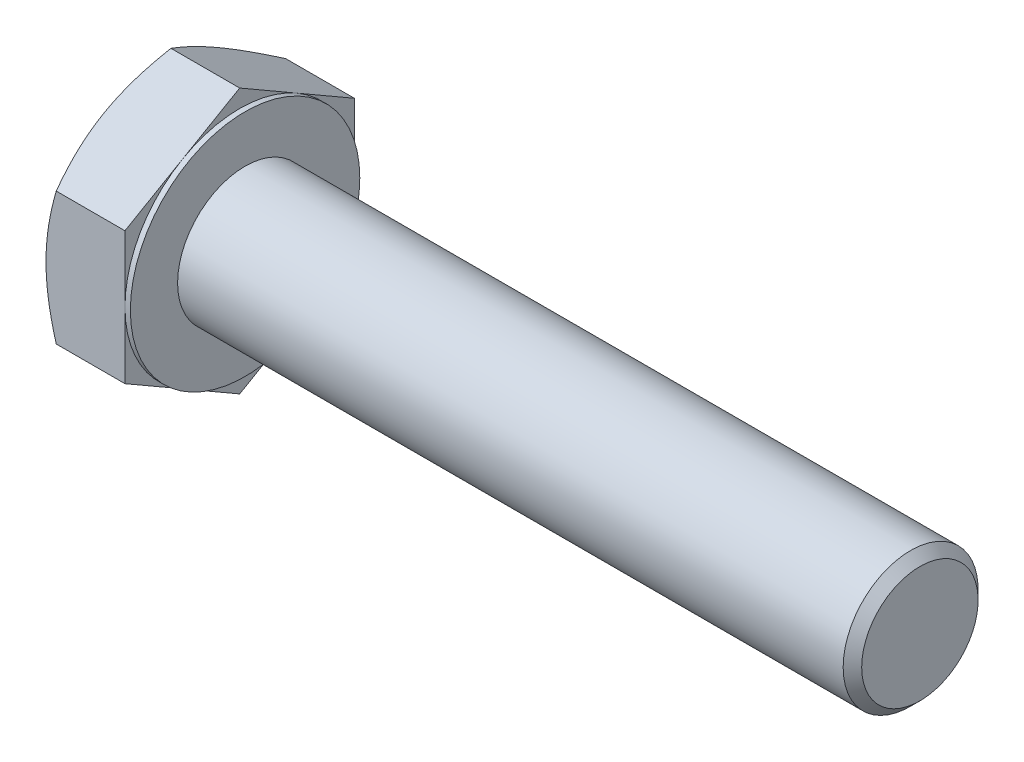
ISO-10303-21;
HEADER;
FILE_DESCRIPTION(('STEP AP214'),'2;1');
FILE_NAME('part.step','',(''),(''),'','','');
FILE_SCHEMA(('AUTOMOTIVE_DESIGN { 1 0 10303 214 1 1 1 1 }'));
ENDSEC;
DATA;
#1=APPLICATION_CONTEXT('core data for automotive mechanical design processes');
#2=APPLICATION_PROTOCOL_DEFINITION('international standard','automotive_design',2000,#1);
#3=PRODUCT_CONTEXT('',#1,'mechanical');
#4=PRODUCT('Part','Part','',(#3));
#5=PRODUCT_RELATED_PRODUCT_CATEGORY('part','',(#4));
#6=PRODUCT_DEFINITION_FORMATION('','',#4);
#7=PRODUCT_DEFINITION_CONTEXT('part definition',#1,'design');
#8=PRODUCT_DEFINITION('design','',#6,#7);
#9=PRODUCT_DEFINITION_SHAPE('','',#8);
#10=(LENGTH_UNIT() NAMED_UNIT(*) SI_UNIT(.MILLI.,.METRE.));
#11=(NAMED_UNIT(*) PLANE_ANGLE_UNIT() SI_UNIT($,.RADIAN.));
#12=(NAMED_UNIT(*) SI_UNIT($,.STERADIAN.) SOLID_ANGLE_UNIT());
#13=UNCERTAINTY_MEASURE_WITH_UNIT(LENGTH_MEASURE(1.E-05),#10,'distance_accuracy_value','');
#14=(GEOMETRIC_REPRESENTATION_CONTEXT(3) GLOBAL_UNCERTAINTY_ASSIGNED_CONTEXT((#13)) GLOBAL_UNIT_ASSIGNED_CONTEXT((#10,
#11,#12)) REPRESENTATION_CONTEXT('',''));
#15=CARTESIAN_POINT('',(0.,0.,0.));
#16=DIRECTION('',(0.,0.,1.));
#17=DIRECTION('',(1.,0.,0.));
#18=AXIS2_PLACEMENT_3D('',#15,#16,#17);
#19=CARTESIAN_POINT('',(12.5,19.6299091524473,0.));
#20=DIRECTION('',(1.,0.,0.));
#21=DIRECTION('',(0.,0.,-1.));
#22=AXIS2_PLACEMENT_3D('',#19,#20,#21);
#23=PLANE('',#22);
#24=CARTESIAN_POINT('',(12.5,0.,0.));
#25=DIRECTION('',(1.,0.,0.));
#26=DIRECTION('',(0.,0.,-1.));
#27=AXIS2_PLACEMENT_3D('',#24,#25,#26);
#28=CIRCLE('',#27,10.);
#29=CARTESIAN_POINT('',(12.5,0.,-10.));
#30=VERTEX_POINT('',#29);
#31=EDGE_CURVE('E273',#30,#30,#28,.F.);
#32=ORIENTED_EDGE('',*,*,#31,.T.);
#33=EDGE_LOOP('',(#32));
#34=FACE_BOUND('',#33,.T.);
#35=CARTESIAN_POINT('',(12.5,0.,0.));
#36=DIRECTION('',(1.,0.,0.));
#37=DIRECTION('',(0.,0.,-1.));
#38=AXIS2_PLACEMENT_3D('',#35,#36,#37);
#39=CIRCLE('',#38,17.);
#40=CARTESIAN_POINT('',(12.5,0.,-17.));
#41=VERTEX_POINT('',#40);
#42=EDGE_CURVE('E292',#41,#41,#39,.T.);
#43=ORIENTED_EDGE('',*,*,#42,.T.);
#44=EDGE_LOOP('',(#43));
#45=FACE_BOUND('',#44,.T.);
#46=ADVANCED_FACE('F35',(#34,#45),#23,.T.);
#47=CARTESIAN_POINT('',(0.,0.,0.));
#48=DIRECTION('',(-1.,0.,0.));
#49=DIRECTION('',(0.,0.,1.));
#50=AXIS2_PLACEMENT_3D('',#47,#48,#49);
#51=CYLINDRICAL_SURFACE('',#50,10.);
#52=ORIENTED_EDGE('',*,*,#31,.F.);
#53=EDGE_LOOP('',(#52));
#54=FACE_BOUND('',#53,.T.);
#55=CARTESIAN_POINT('',(111.126,0.,0.));
#56=DIRECTION('',(-1.,0.,0.));
#57=DIRECTION('',(0.,0.,1.));
#58=AXIS2_PLACEMENT_3D('',#55,#56,#57);
#59=CIRCLE('',#58,10.);
#60=CARTESIAN_POINT('',(111.126,0.,10.));
#61=VERTEX_POINT('',#60);
#62=EDGE_CURVE('E270',#61,#61,#59,.T.);
#63=ORIENTED_EDGE('',*,*,#62,.T.);
#64=EDGE_LOOP('',(#63));
#65=FACE_BOUND('',#64,.T.);
#66=ADVANCED_FACE('F244',(#54,#65),#51,.T.);
#67=CARTESIAN_POINT('',(112.5,0.,0.));
#68=DIRECTION('',(-1.,0.,0.));
#69=DIRECTION('',(0.,0.,1.));
#70=AXIS2_PLACEMENT_3D('',#67,#68,#69);
#71=CONICAL_SURFACE('',#70,8.626,0.785398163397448);
#72=ORIENTED_EDGE('',*,*,#62,.F.);
#73=EDGE_LOOP('',(#72));
#74=FACE_BOUND('',#73,.T.);
#75=CARTESIAN_POINT('',(112.5,0.,0.));
#76=DIRECTION('',(-1.,0.,0.));
#77=DIRECTION('',(0.,0.,1.));
#78=AXIS2_PLACEMENT_3D('',#75,#76,#77);
#79=CIRCLE('',#78,8.626);
#80=CARTESIAN_POINT('',(112.5,0.,8.626));
#81=VERTEX_POINT('',#80);
#82=EDGE_CURVE('E268',#81,#81,#79,.T.);
#83=ORIENTED_EDGE('',*,*,#82,.T.);
#84=EDGE_LOOP('',(#83));
#85=FACE_BOUND('',#84,.T.);
#86=ADVANCED_FACE('F249',(#74,#85),#71,.T.);
#87=CARTESIAN_POINT('',(112.5,0.,0.));
#88=DIRECTION('',(-1.,0.,0.));
#89=DIRECTION('',(0.,0.,1.));
#90=AXIS2_PLACEMENT_3D('',#87,#88,#89);
#91=PLANE('',#90);
#92=ORIENTED_EDGE('',*,*,#82,.F.);
#93=EDGE_LOOP('',(#92));
#94=FACE_BOUND('',#93,.T.);
#95=ADVANCED_FACE('F256',(#94),#91,.F.);
#96=CARTESIAN_POINT('',(11.7,17.,0.));
#97=DIRECTION('',(1.,0.,0.));
#98=DIRECTION('',(0.,0.,-1.));
#99=AXIS2_PLACEMENT_3D('',#96,#97,#98);
#100=PLANE('',#99);
#101=DIRECTION('',(0.,0.500000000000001,0.866025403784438));
#102=VECTOR('',#101,1.);
#103=CARTESIAN_POINT('',(11.7,9.81495457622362,-17.));
#104=LINE('',#103,#102);
#105=CARTESIAN_POINT('',(11.7,9.81495457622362,-17.));
#106=VERTEX_POINT('',#105);
#107=CARTESIAN_POINT('',(11.7,14.7224318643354,-8.50000000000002));
#108=VERTEX_POINT('',#107);
#109=EDGE_CURVE('E168',#106,#108,#104,.T.);
#110=ORIENTED_EDGE('',*,*,#109,.T.);
#111=CARTESIAN_POINT('',(11.7,0.,0.));
#112=DIRECTION('',(-1.,0.,0.));
#113=DIRECTION('',(0.,0.,1.));
#114=AXIS2_PLACEMENT_3D('',#111,#112,#113);
#115=CIRCLE('',#114,17.);
#116=CARTESIAN_POINT('',(11.7,0.,-17.));
#117=VERTEX_POINT('',#116);
#118=EDGE_CURVE('E51',#108,#117,#115,.T.);
#119=ORIENTED_EDGE('',*,*,#118,.T.);
#120=DIRECTION('',(0.,1.,0.));
#121=VECTOR('',#120,1.);
#122=CARTESIAN_POINT('',(11.7,9.81495457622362,-17.));
#123=LINE('',#122,#121);
#124=EDGE_CURVE('E40',#117,#106,#123,.T.);
#125=ORIENTED_EDGE('',*,*,#124,.T.);
#126=EDGE_LOOP('',(#110,#119,#125));
#127=FACE_BOUND('',#126,.T.);
#128=ADVANCED_FACE('F259',(#127),#100,.T.);
#129=CARTESIAN_POINT('',(11.7,19.6299091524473,0.));
#130=VERTEX_POINT('',#129);
#131=EDGE_CURVE('E166',#108,#130,#104,.T.);
#132=ORIENTED_EDGE('',*,*,#131,.T.);
#133=DIRECTION('',(0.,-0.500000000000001,0.866025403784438));
#134=VECTOR('',#133,1.);
#135=CARTESIAN_POINT('',(11.7,19.6299091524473,0.));
#136=LINE('',#135,#134);
#137=CARTESIAN_POINT('',(11.7,14.7224318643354,8.50000000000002));
#138=VERTEX_POINT('',#137);
#139=EDGE_CURVE('E165',#130,#138,#136,.T.);
#140=ORIENTED_EDGE('',*,*,#139,.T.);
#141=EDGE_CURVE('E154',#138,#108,#115,.T.);
#142=ORIENTED_EDGE('',*,*,#141,.T.);
#143=EDGE_LOOP('',(#132,#140,#142));
#144=FACE_BOUND('',#143,.T.);
#145=ADVANCED_FACE('F264',(#144),#100,.T.);
#146=CARTESIAN_POINT('',(11.7,9.81495457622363,17.));
#147=VERTEX_POINT('',#146);
#148=EDGE_CURVE('E133',#138,#147,#136,.T.);
#149=ORIENTED_EDGE('',*,*,#148,.T.);
#150=DIRECTION('',(0.,-1.,0.));
#151=VECTOR('',#150,1.);
#152=CARTESIAN_POINT('',(11.7,9.81495457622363,17.));
#153=LINE('',#152,#151);
#154=CARTESIAN_POINT('',(11.7,0.,17.));
#155=VERTEX_POINT('',#154);
#156=EDGE_CURVE('E127',#147,#155,#153,.T.);
#157=ORIENTED_EDGE('',*,*,#156,.T.);
#158=EDGE_CURVE('E131',#155,#138,#115,.T.);
#159=ORIENTED_EDGE('',*,*,#158,.T.);
#160=EDGE_LOOP('',(#149,#157,#159));
#161=FACE_BOUND('',#160,.T.);
#162=ADVANCED_FACE('F129',(#161),#100,.T.);
#163=CARTESIAN_POINT('',(11.7,-9.81495457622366,17.));
#164=VERTEX_POINT('',#163);
#165=EDGE_CURVE('E137',#155,#164,#153,.T.);
#166=ORIENTED_EDGE('',*,*,#165,.T.);
#167=DIRECTION('',(0.,-0.500000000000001,-0.866025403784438));
#168=VECTOR('',#167,1.);
#169=CARTESIAN_POINT('',(11.7,-19.6299091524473,0.));
#170=LINE('',#169,#168);
#171=CARTESIAN_POINT('',(11.7,-14.7224318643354,8.50000000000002));
#172=VERTEX_POINT('',#171);
#173=EDGE_CURVE('E144',#164,#172,#170,.T.);
#174=ORIENTED_EDGE('',*,*,#173,.T.);
#175=EDGE_CURVE('E141',#172,#155,#115,.T.);
#176=ORIENTED_EDGE('',*,*,#175,.T.);
#177=EDGE_LOOP('',(#166,#174,#176));
#178=FACE_BOUND('',#177,.T.);
#179=ADVANCED_FACE('F142',(#178),#100,.T.);
#180=CARTESIAN_POINT('',(11.7,-19.6299091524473,0.));
#181=VERTEX_POINT('',#180);
#182=EDGE_CURVE('E160',#172,#181,#170,.T.);
#183=ORIENTED_EDGE('',*,*,#182,.T.);
#184=DIRECTION('',(0.,0.500000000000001,-0.866025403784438));
#185=VECTOR('',#184,1.);
#186=CARTESIAN_POINT('',(11.7,-9.81495457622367,-17.));
#187=LINE('',#186,#185);
#188=CARTESIAN_POINT('',(11.7,-14.7224318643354,-8.50000000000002));
#189=VERTEX_POINT('',#188);
#190=EDGE_CURVE('E328',#181,#189,#187,.T.);
#191=ORIENTED_EDGE('',*,*,#190,.T.);
#192=EDGE_CURVE('E148',#189,#172,#115,.T.);
#193=ORIENTED_EDGE('',*,*,#192,.T.);
#194=EDGE_LOOP('',(#183,#191,#193));
#195=FACE_BOUND('',#194,.T.);
#196=ADVANCED_FACE('F333',(#195),#100,.T.);
#197=CARTESIAN_POINT('',(11.7,-9.81495457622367,-17.));
#198=VERTEX_POINT('',#197);
#199=EDGE_CURVE('E155',#189,#198,#187,.T.);
#200=ORIENTED_EDGE('',*,*,#199,.T.);
#201=EDGE_CURVE('E11',#198,#117,#123,.T.);
#202=ORIENTED_EDGE('',*,*,#201,.T.);
#203=EDGE_CURVE('E346',#117,#189,#115,.T.);
#204=ORIENTED_EDGE('',*,*,#203,.T.);
#205=EDGE_LOOP('',(#200,#202,#204));
#206=FACE_BOUND('',#205,.T.);
#207=ADVANCED_FACE('F265',(#206),#100,.T.);
#208=CARTESIAN_POINT('',(0.,0.,0.));
#209=DIRECTION('',(-1.,0.,0.));
#210=DIRECTION('',(0.,0.,1.));
#211=AXIS2_PLACEMENT_3D('',#208,#209,#210);
#212=CYLINDRICAL_SURFACE('',#211,17.);
#213=ORIENTED_EDGE('',*,*,#118,.F.);
#214=ORIENTED_EDGE('',*,*,#141,.F.);
#215=ORIENTED_EDGE('',*,*,#158,.F.);
#216=ORIENTED_EDGE('',*,*,#175,.F.);
#217=ORIENTED_EDGE('',*,*,#192,.F.);
#218=ORIENTED_EDGE('',*,*,#203,.F.);
#219=EDGE_LOOP('',(#213,#214,#215,#216,#217,#218));
#220=FACE_BOUND('',#219,.T.);
#221=ORIENTED_EDGE('',*,*,#42,.F.);
#222=EDGE_LOOP('',(#221));
#223=FACE_BOUND('',#222,.T.);
#224=ADVANCED_FACE('F151',(#220,#223),#212,.T.);
#225=CARTESIAN_POINT('',(0.,19.6299091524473,0.));
#226=DIRECTION('',(1.,0.,0.));
#227=DIRECTION('',(0.,0.,-1.));
#228=AXIS2_PLACEMENT_3D('',#225,#226,#227);
#229=PLANE('',#228);
#230=CARTESIAN_POINT('',(0.,0.,0.));
#231=DIRECTION('',(1.,0.,0.));
#232=DIRECTION('',(0.,0.,-1.));
#233=AXIS2_PLACEMENT_3D('',#230,#231,#232);
#234=CIRCLE('',#233,17.);
#235=CARTESIAN_POINT('',(0.,0.,-17.));
#236=VERTEX_POINT('',#235);
#237=CARTESIAN_POINT('',(0.,14.7224318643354,-8.50000000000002));
#238=VERTEX_POINT('',#237);
#239=EDGE_CURVE('E291',#236,#238,#234,.T.);
#240=ORIENTED_EDGE('',*,*,#239,.F.);
#241=CARTESIAN_POINT('',(0.,-14.7224318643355,-8.50000000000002));
#242=VERTEX_POINT('',#241);
#243=EDGE_CURVE('E288',#242,#236,#234,.T.);
#244=ORIENTED_EDGE('',*,*,#243,.F.);
#245=CARTESIAN_POINT('',(0.,-14.7224318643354,8.50000000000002));
#246=VERTEX_POINT('',#245);
#247=EDGE_CURVE('E290',#246,#242,#234,.T.);
#248=ORIENTED_EDGE('',*,*,#247,.F.);
#249=CARTESIAN_POINT('',(0.,0.,17.));
#250=VERTEX_POINT('',#249);
#251=EDGE_CURVE('E300',#250,#246,#234,.T.);
#252=ORIENTED_EDGE('',*,*,#251,.F.);
#253=CARTESIAN_POINT('',(0.,0.,0.));
#254=DIRECTION('',(-1.,0.,0.));
#255=DIRECTION('',(0.,0.,1.));
#256=AXIS2_PLACEMENT_3D('',#253,#254,#255);
#257=CIRCLE('',#256,17.);
#258=CARTESIAN_POINT('',(0.,14.7224318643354,8.50000000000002));
#259=VERTEX_POINT('',#258);
#260=EDGE_CURVE('E169',#250,#259,#257,.T.);
#261=ORIENTED_EDGE('',*,*,#260,.T.);
#262=EDGE_CURVE('E295',#238,#259,#234,.T.);
#263=ORIENTED_EDGE('',*,*,#262,.F.);
#264=EDGE_LOOP('',(#240,#244,#248,#252,#261,#263));
#265=FACE_BOUND('',#264,.T.);
#266=ADVANCED_FACE('F198',(#265),#229,.F.);
#267=CARTESIAN_POINT('',(0.,0.,0.));
#268=DIRECTION('',(1.,0.,0.));
#269=DIRECTION('',(0.,0.,-1.));
#270=AXIS2_PLACEMENT_3D('',#267,#268,#269);
#271=CONICAL_SURFACE('',#270,17.,1.0471975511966);
#272=CARTESIAN_POINT('',(1.51844542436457,9.81483910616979,17.0002));
#273=CARTESIAN_POINT('',(1.39390284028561,10.0305678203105,16.6265469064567));
#274=CARTESIAN_POINT('',(1.27501178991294,10.2471379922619,16.251436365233));
#275=CARTESIAN_POINT('',(1.05010368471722,10.6820149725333,15.4982073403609));
#276=CARTESIAN_POINT('',(0.944090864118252,10.9003223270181,15.1200879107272));
#277=CARTESIAN_POINT('',(0.746364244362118,11.3390955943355,14.3601103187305));
#278=CARTESIAN_POINT('',(0.654684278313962,11.5595653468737,13.9782455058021));
#279=CARTESIAN_POINT('',(0.487592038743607,12.0020367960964,13.2118624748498));
#280=CARTESIAN_POINT('',(0.412178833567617,12.2240384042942,12.8273444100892));
#281=CARTESIAN_POINT('',(0.280827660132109,12.6638851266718,12.0655075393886));
#282=CARTESIAN_POINT('',(0.224454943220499,12.8816975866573,11.6882452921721));
#283=CARTESIAN_POINT('',(0.129930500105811,13.3183205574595,10.9319921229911));
#284=CARTESIAN_POINT('',(0.0917791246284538,13.5371310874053,10.5530011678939));
#285=CARTESIAN_POINT('',(0.03466066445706,13.9751197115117,9.79438261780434));
#286=CARTESIAN_POINT('',(0.0156707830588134,14.1942970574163,9.41475631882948));
#287=CARTESIAN_POINT('',(-0.0027162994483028,14.6328540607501,8.65515330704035));
#288=CARTESIAN_POINT('',(-0.00211410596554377,14.8522337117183,8.27517660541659));
#289=CARTESIAN_POINT('',(0.0173147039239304,15.2623694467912,7.56480067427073));
#290=CARTESIAN_POINT('',(0.0337721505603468,15.4531547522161,7.23435083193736));
#291=CARTESIAN_POINT('',(0.0811925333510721,15.8342702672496,6.57423939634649));
#292=CARTESIAN_POINT('',(0.11215526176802,16.0246004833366,6.24457779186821));
#293=CARTESIAN_POINT('',(0.18804894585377,16.4047337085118,5.58616773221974));
#294=CARTESIAN_POINT('',(0.232992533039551,16.5945360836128,5.25742037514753));
#295=CARTESIAN_POINT('',(0.33605485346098,16.9732372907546,4.60149064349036));
#296=CARTESIAN_POINT('',(0.394173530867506,17.1621361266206,4.27430826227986));
#297=CARTESIAN_POINT('',(0.589770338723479,17.7355629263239,3.281103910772));
#298=CARTESIAN_POINT('',(0.746752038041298,18.1184303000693,2.61795816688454));
#299=CARTESIAN_POINT('',(1.10303610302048,18.8784560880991,1.30155488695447));
#300=CARTESIAN_POINT('',(1.30225479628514,19.2556242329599,0.648280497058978));
#301=CARTESIAN_POINT('',(1.51844542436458,19.6300246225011,-0.000199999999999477));
#302=B_SPLINE_CURVE_WITH_KNOTS('',3,(#272,#273,#274,#275,#276,#277,#278,#279,#280,#281,#282,
#283,#284,#285,#286,#287,#288,#289,#290,#291,#292,#293,#294,#295,#296,#297,#298,#299,#300,#301),
.UNSPECIFIED.,.F.,.F.,(4,2,2,2,2,2,2,2,2,2,2,2,2,2,4),(0.,1.34725361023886,2.6949489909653,
4.04577911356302,5.39653184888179,6.71394507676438,8.0313836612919,9.34725301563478,
10.6630817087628,11.808581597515,12.9540650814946,14.1005865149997,15.2471030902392,
17.590639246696,19.929575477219),.UNSPECIFIED.);
#303=CARTESIAN_POINT('',(1.51837875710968,19.6299091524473,0.));
#304=VERTEX_POINT('',#303);
#305=EDGE_CURVE('E216',#259,#304,#302,.T.);
#306=ORIENTED_EDGE('',*,*,#305,.T.);
#307=CARTESIAN_POINT('',(1.51844542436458,19.6300246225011,0.0002));
#308=CARTESIAN_POINT('',(1.39390284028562,19.4142959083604,-0.373453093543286));
#309=CARTESIAN_POINT('',(1.27501178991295,19.197725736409,-0.74856363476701));
#310=CARTESIAN_POINT('',(1.05010368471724,18.7628487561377,-1.50179265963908));
#311=CARTESIAN_POINT('',(0.944090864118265,18.5445414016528,-1.87991208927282));
#312=CARTESIAN_POINT('',(0.746364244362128,18.1057681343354,-2.6398896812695));
#313=CARTESIAN_POINT('',(0.654684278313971,17.8852983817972,-3.02175449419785));
#314=CARTESIAN_POINT('',(0.487592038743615,17.4428269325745,-3.78813752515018));
#315=CARTESIAN_POINT('',(0.412178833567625,17.2208253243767,-4.1726555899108));
#316=CARTESIAN_POINT('',(0.280827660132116,16.7809786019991,-4.93449246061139));
#317=CARTESIAN_POINT('',(0.224454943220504,16.5631661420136,-5.31175470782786));
#318=CARTESIAN_POINT('',(0.129930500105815,16.1265431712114,-6.06800787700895));
#319=CARTESIAN_POINT('',(0.0917791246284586,15.9077326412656,-6.44699883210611));
#320=CARTESIAN_POINT('',(0.0346606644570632,15.4697440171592,-7.20561738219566));
#321=CARTESIAN_POINT('',(0.0156707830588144,15.2505666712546,-7.58524368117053));
#322=CARTESIAN_POINT('',(-0.00271629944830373,14.8120096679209,-8.34484669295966));
#323=CARTESIAN_POINT('',(-0.00211410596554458,14.5926300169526,-8.72482339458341));
#324=CARTESIAN_POINT('',(0.0173147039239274,14.1824942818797,-9.43519932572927));
#325=CARTESIAN_POINT('',(0.0337721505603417,13.9917089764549,-9.76564916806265));
#326=CARTESIAN_POINT('',(0.0811925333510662,13.6105934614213,-10.4257606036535));
#327=CARTESIAN_POINT('',(0.112155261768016,13.4202632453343,-10.7554222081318));
#328=CARTESIAN_POINT('',(0.188048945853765,13.0401300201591,-11.4138322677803));
#329=CARTESIAN_POINT('',(0.232992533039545,12.8503276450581,-11.7425796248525));
#330=CARTESIAN_POINT('',(0.336054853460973,12.4716264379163,-12.3985093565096));
#331=CARTESIAN_POINT('',(0.394173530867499,12.2827276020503,-12.7256917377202));
#332=CARTESIAN_POINT('',(0.589770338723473,11.709300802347,-13.718896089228));
#333=CARTESIAN_POINT('',(0.746752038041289,11.3264334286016,-14.3820418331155));
#334=CARTESIAN_POINT('',(1.10303610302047,10.5664076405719,-15.6984451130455));
#335=CARTESIAN_POINT('',(1.30225479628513,10.189239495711,-16.351719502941));
#336=CARTESIAN_POINT('',(1.51844542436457,9.81483910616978,-17.0002));
#337=B_SPLINE_CURVE_WITH_KNOTS('',3,(#307,#308,#309,#310,#311,#312,#313,#314,#315,#316,#317,
#318,#319,#320,#321,#322,#323,#324,#325,#326,#327,#328,#329,#330,#331,#332,#333,#334,#335,#336),
.UNSPECIFIED.,.F.,.F.,(4,2,2,2,2,2,2,2,2,2,2,2,2,2,4),(0.,1.34725361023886,2.6949489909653,
4.04577911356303,5.39653184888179,6.71394507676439,8.03138366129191,9.3472530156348,
10.6630817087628,11.808581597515,12.9540650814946,14.1005865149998,15.2471030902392,
17.590639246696,19.929575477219),.UNSPECIFIED.);
#338=EDGE_CURVE('E59',#304,#238,#337,.T.);
#339=ORIENTED_EDGE('',*,*,#338,.T.);
#340=ORIENTED_EDGE('',*,*,#262,.T.);
#341=EDGE_LOOP('',(#306,#339,#340));
#342=FACE_BOUND('',#341,.T.);
#343=ADVANCED_FACE('F342',(#342),#271,.T.);
#344=CARTESIAN_POINT('',(8.32998257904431,-26.4332410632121,17.));
#345=CARTESIAN_POINT('',(8.14957795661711,-26.0617207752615,17.));
#346=CARTESIAN_POINT('',(7.97006771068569,-25.6897663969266,17.));
#347=CARTESIAN_POINT('',(7.61303838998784,-24.9448988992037,17.));
#348=CARTESIAN_POINT('',(7.43551933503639,-24.5719857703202,17.));
#349=CARTESIAN_POINT('',(6.90620624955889,-23.4515740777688,17.));
#350=CARTESIAN_POINT('',(6.55770928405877,-22.7025120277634,17.));
#351=CARTESIAN_POINT('',(5.86974011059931,-21.1953548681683,17.));
#352=CARTESIAN_POINT('',(5.5303267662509,-20.4372328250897,17.));
#353=CARTESIAN_POINT('',(4.86529195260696,-18.9149840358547,17.));
#354=CARTESIAN_POINT('',(4.53966983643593,-18.1508575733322,17.));
#355=CARTESIAN_POINT('',(3.89555967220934,-16.5904196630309,17.));
#356=CARTESIAN_POINT('',(3.57764741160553,-15.7938693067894,17.));
#357=CARTESIAN_POINT('',(2.96571562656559,-14.1914693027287,17.));
#358=CARTESIAN_POINT('',(2.67169877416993,-13.3856186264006,17.));
#359=CARTESIAN_POINT('',(2.11523043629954,-11.7648483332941,17.));
#360=CARTESIAN_POINT('',(1.85271563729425,-10.9499506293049,17.));
#361=CARTESIAN_POINT('',(1.36761452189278,-9.30838864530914,17.));
#362=CARTESIAN_POINT('',(1.14501570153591,-8.4817281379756,17.));
#363=CARTESIAN_POINT('',(0.84968713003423,-7.23506436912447,17.));
#364=CARTESIAN_POINT('',(0.757873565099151,-6.81955500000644,17.));
#365=CARTESIAN_POINT('',(0.588188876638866,-5.98568427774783,17.));
#366=CARTESIAN_POINT('',(0.51031746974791,-5.56732298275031,17.));
#367=CARTESIAN_POINT('',(0.369887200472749,-4.72803069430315,17.));
#368=CARTESIAN_POINT('',(0.307328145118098,-4.30709973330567,17.));
#369=CARTESIAN_POINT('',(0.198768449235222,-3.46311148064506,17.));
#370=CARTESIAN_POINT('',(0.152767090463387,-3.04005428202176,17.));
#371=CARTESIAN_POINT('',(0.0788167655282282,-2.19795531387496,17.));
#372=CARTESIAN_POINT('',(0.0506386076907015,-1.77893379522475,17.));
#373=CARTESIAN_POINT('',(0.0120312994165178,-0.940075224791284,17.));
#374=CARTESIAN_POINT('',(0.00160185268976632,-0.520238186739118,17.));
#375=CARTESIAN_POINT('',(-0.0012597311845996,0.319501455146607,17.));
#376=CARTESIAN_POINT('',(0.00630819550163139,0.739404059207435,17.));
#377=CARTESIAN_POINT('',(0.039255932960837,1.57851450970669,17.));
#378=CARTESIAN_POINT('',(0.0646365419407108,1.99772232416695,17.));
#379=CARTESIAN_POINT('',(0.146329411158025,3.00313432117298,17.));
#380=CARTESIAN_POINT('',(0.210977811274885,3.58867322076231,17.));
#381=CARTESIAN_POINT('',(0.371522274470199,4.75545415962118,17.));
#382=CARTESIAN_POINT('',(0.467422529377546,5.33669561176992,17.));
#383=CARTESIAN_POINT('',(0.687059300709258,6.49431136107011,17.));
#384=CARTESIAN_POINT('',(0.810817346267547,7.07068153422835,17.));
#385=CARTESIAN_POINT('',(1.08238903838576,8.21766393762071,17.));
#386=CARTESIAN_POINT('',(1.23020233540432,8.78827625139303,17.));
#387=CARTESIAN_POINT('',(1.54978178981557,9.9363085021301,17.));
#388=CARTESIAN_POINT('',(1.72200498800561,10.5136003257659,17.));
#389=CARTESIAN_POINT('',(2.0843777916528,11.6624980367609,17.));
#390=CARTESIAN_POINT('',(2.27452751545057,12.234103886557,17.));
#391=CARTESIAN_POINT('',(2.66972269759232,13.3719095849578,17.));
#392=CARTESIAN_POINT('',(2.87476328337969,13.9381111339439,17.));
#393=CARTESIAN_POINT('',(3.29731504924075,15.0658140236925,17.));
#394=CARTESIAN_POINT('',(3.5148260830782,15.6273154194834,17.));
#395=CARTESIAN_POINT('',(4.04214849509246,16.9518553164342,17.));
#396=CARTESIAN_POINT('',(4.35649197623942,17.713086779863,17.));
#397=CARTESIAN_POINT('',(5.00050456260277,19.2290585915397,17.));
#398=CARTESIAN_POINT('',(5.330174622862,19.9837985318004,17.));
#399=CARTESIAN_POINT('',(6.0017726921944,21.487995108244,17.));
#400=CARTESIAN_POINT('',(6.34370345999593,22.237450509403,17.));
#401=CARTESIAN_POINT('',(7.03734981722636,23.7317883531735,17.));
#402=CARTESIAN_POINT('',(7.38906519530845,24.4766708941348,17.));
#403=CARTESIAN_POINT('',(8.10084426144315,25.9634418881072,17.));
#404=CARTESIAN_POINT('',(8.46091674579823,26.7053261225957,17.));
#405=CARTESIAN_POINT('',(9.18760696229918,28.1858814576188,17.));
#406=CARTESIAN_POINT('',(9.55422472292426,28.9245525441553,17.));
#407=CARTESIAN_POINT('',(10.292836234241,30.3990810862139,17.));
#408=CARTESIAN_POINT('',(10.664829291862,31.1349388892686,17.));
#409=CARTESIAN_POINT('',(11.4133557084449,32.6043374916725,17.));
#410=CARTESIAN_POINT('',(11.7898890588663,33.3378782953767,17.));
#411=CARTESIAN_POINT('',(12.8616246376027,35.4124553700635,17.));
#412=CARTESIAN_POINT('',(13.5613220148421,36.7511693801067,17.));
#413=CARTESIAN_POINT('',(14.9702873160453,39.4236006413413,17.));
#414=CARTESIAN_POINT('',(15.6795555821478,40.7573177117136,17.));
#415=CARTESIAN_POINT('',(17.1036264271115,43.4174788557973,17.));
#416=CARTESIAN_POINT('',(17.8184106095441,44.7439327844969,17.));
#417=CARTESIAN_POINT('',(18.8948462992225,46.7312563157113,17.));
#418=CARTESIAN_POINT('',(19.2543582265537,47.393286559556,17.));
#419=CARTESIAN_POINT('',(19.9746598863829,48.7166502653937,17.));
#420=CARTESIAN_POINT('',(20.3354496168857,49.3779837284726,17.));
#421=CARTESIAN_POINT('',(20.696804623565,50.0390082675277,17.));
#422=B_SPLINE_CURVE_WITH_KNOTS('',3,(#344,#345,#346,#347,#348,#349,#350,#351,#352,#353,#354,
#355,#356,#357,#358,#359,#360,#361,#362,#363,#364,#365,#366,#367,#368,#369,#370,#371,#372,#373,
#374,#375,#376,#377,#378,#379,#380,#381,#382,#383,#384,#385,#386,#387,#388,#389,#390,#391,#392,
#393,#394,#395,#396,#397,#398,#399,#400,#401,#402,#403,#404,#405,#406,#407,#408,#409,#410,#411,
#412,#413,#414,#415,#416,#417,#418,#419,#420,#421),.UNSPECIFIED.,.F.,.F.,(4,2,2,2,2,2,2,2,2,2,2,
2,2,2,2,2,2,2,2,2,2,2,2,2,2,2,2,2,2,2,2,2,2,2,2,2,2,2,4),(0.,1.23901285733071,2.47803803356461,
4.95645146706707,7.44824208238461,9.93991569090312,12.5125679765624,15.0855075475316,
17.6531861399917,20.2200589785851,21.4964599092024,22.7728348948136,24.0491937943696,
25.3254973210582,26.5850358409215,27.8445533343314,29.1040752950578,30.3636537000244,
32.1299687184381,33.8965207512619,35.6644427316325,37.4323390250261,39.2392932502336,
41.0462594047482,42.8526369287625,44.6589932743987,47.1295074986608,49.6001758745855,
52.0714036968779,54.5425781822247,57.016483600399,59.490399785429,61.9639997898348,
64.4375951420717,68.9691570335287,73.5008813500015,78.0212126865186,80.2812549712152,
82.5412937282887),.UNSPECIFIED.);
#423=CARTESIAN_POINT('',(1.51837875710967,9.81495457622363,17.));
#424=VERTEX_POINT('',#423);
#425=EDGE_CURVE('E228',#250,#424,#422,.T.);
#426=ORIENTED_EDGE('',*,*,#425,.T.);
#427=EDGE_CURVE('E227',#424,#259,#302,.T.);
#428=ORIENTED_EDGE('',*,*,#427,.T.);
#429=ORIENTED_EDGE('',*,*,#260,.F.);
#430=EDGE_LOOP('',(#426,#428,#429));
#431=FACE_BOUND('',#430,.T.);
#432=ADVANCED_FACE('F338',(#431),#271,.T.);
#433=CARTESIAN_POINT('',(1.51837875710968,-9.81495457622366,17.));
#434=VERTEX_POINT('',#433);
#435=EDGE_CURVE('E271',#434,#250,#422,.T.);
#436=ORIENTED_EDGE('',*,*,#435,.T.);
#437=ORIENTED_EDGE('',*,*,#251,.T.);
#438=CARTESIAN_POINT('',(1.51844542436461,-19.6300246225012,-0.0002));
#439=CARTESIAN_POINT('',(1.39390284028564,-19.4142959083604,0.373453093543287));
#440=CARTESIAN_POINT('',(1.27501178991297,-19.197725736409,0.74856363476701));
#441=CARTESIAN_POINT('',(1.05010368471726,-18.7628487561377,1.50179265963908));
#442=CARTESIAN_POINT('',(0.944090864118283,-18.5445414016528,1.87991208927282));
#443=CARTESIAN_POINT('',(0.746364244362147,-18.1057681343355,2.63988968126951));
#444=CARTESIAN_POINT('',(0.654684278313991,-17.8852983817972,3.02175449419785));
#445=CARTESIAN_POINT('',(0.487592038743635,-17.4428269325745,3.78813752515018));
#446=CARTESIAN_POINT('',(0.412178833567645,-17.2208253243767,4.1726555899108));
#447=CARTESIAN_POINT('',(0.280827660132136,-16.7809786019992,4.93449246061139));
#448=CARTESIAN_POINT('',(0.224454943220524,-16.5631661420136,5.31175470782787));
#449=CARTESIAN_POINT('',(0.129930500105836,-16.1265431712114,6.06800787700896));
#450=CARTESIAN_POINT('',(0.091779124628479,-15.9077326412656,6.44699883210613));
#451=CARTESIAN_POINT('',(0.0346606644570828,-15.4697440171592,7.20561738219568));
#452=CARTESIAN_POINT('',(0.0156707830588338,-15.2505666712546,7.58524368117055));
#453=CARTESIAN_POINT('',(-0.00271629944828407,-14.8120096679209,8.34484669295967));
#454=CARTESIAN_POINT('',(-0.00211410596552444,-14.5926300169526,8.72482339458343));
#455=CARTESIAN_POINT('',(0.0173147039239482,-14.1824942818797,9.43519932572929));
#456=CARTESIAN_POINT('',(0.0337721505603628,-13.9917089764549,9.76564916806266));
#457=CARTESIAN_POINT('',(0.0811925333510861,-13.6105934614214,10.4257606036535));
#458=CARTESIAN_POINT('',(0.112155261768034,-13.4202632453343,10.7554222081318));
#459=CARTESIAN_POINT('',(0.188048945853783,-13.0401300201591,11.4138322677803));
#460=CARTESIAN_POINT('',(0.232992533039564,-12.8503276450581,11.7425796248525));
#461=CARTESIAN_POINT('',(0.336054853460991,-12.4716264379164,12.3985093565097));
#462=CARTESIAN_POINT('',(0.394173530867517,-12.2827276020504,12.7256917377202));
#463=CARTESIAN_POINT('',(0.589770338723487,-11.709300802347,13.718896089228));
#464=CARTESIAN_POINT('',(0.746752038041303,-11.3264334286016,14.3820418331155));
#465=CARTESIAN_POINT('',(1.10303610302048,-10.5664076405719,15.6984451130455));
#466=CARTESIAN_POINT('',(1.30225479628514,-10.189239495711,16.351719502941));
#467=CARTESIAN_POINT('',(1.51844542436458,-9.81483910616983,17.0002));
#468=B_SPLINE_CURVE_WITH_KNOTS('',3,(#438,#439,#440,#441,#442,#443,#444,#445,#446,#447,#448,
#449,#450,#451,#452,#453,#454,#455,#456,#457,#458,#459,#460,#461,#462,#463,#464,#465,#466,#467),
.UNSPECIFIED.,.F.,.F.,(4,2,2,2,2,2,2,2,2,2,2,2,2,2,4),(0.,1.34725361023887,2.6949489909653,
4.04577911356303,5.3965318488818,6.7139450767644,8.03138366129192,9.34725301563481,
10.6630817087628,11.808581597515,12.9540650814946,14.1005865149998,15.2471030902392,
17.590639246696,19.929575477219),.UNSPECIFIED.);
#469=EDGE_CURVE('E218',#246,#434,#468,.T.);
#470=ORIENTED_EDGE('',*,*,#469,.T.);
#471=EDGE_LOOP('',(#436,#437,#470));
#472=FACE_BOUND('',#471,.T.);
#473=ADVANCED_FACE('F187',(#472),#271,.T.);
#474=CARTESIAN_POINT('',(1.51837875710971,-19.6299091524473,0.));
#475=VERTEX_POINT('',#474);
#476=EDGE_CURVE('E211',#475,#246,#468,.T.);
#477=ORIENTED_EDGE('',*,*,#476,.T.);
#478=ORIENTED_EDGE('',*,*,#247,.T.);
#479=CARTESIAN_POINT('',(1.51844542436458,-9.81483910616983,-17.0002));
#480=CARTESIAN_POINT('',(1.39390284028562,-10.0305678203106,-16.6265469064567));
#481=CARTESIAN_POINT('',(1.27501178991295,-10.247137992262,-16.251436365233));
#482=CARTESIAN_POINT('',(1.05010368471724,-10.6820149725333,-15.4982073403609));
#483=CARTESIAN_POINT('',(0.944090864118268,-10.9003223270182,-15.1200879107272));
#484=CARTESIAN_POINT('',(0.746364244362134,-11.3390955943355,-14.3601103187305));
#485=CARTESIAN_POINT('',(0.654684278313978,-11.5595653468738,-13.9782455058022));
#486=CARTESIAN_POINT('',(0.487592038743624,-12.0020367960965,-13.2118624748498));
#487=CARTESIAN_POINT('',(0.412178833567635,-12.2240384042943,-12.8273444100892));
#488=CARTESIAN_POINT('',(0.280827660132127,-12.6638851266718,-12.0655075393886));
#489=CARTESIAN_POINT('',(0.224454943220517,-12.8816975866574,-11.6882452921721));
#490=CARTESIAN_POINT('',(0.12993050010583,-13.3183205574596,-10.9319921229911));
#491=CARTESIAN_POINT('',(0.0917791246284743,-13.5371310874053,-10.5530011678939));
#492=CARTESIAN_POINT('',(0.0346606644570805,-13.9751197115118,-9.79438261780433));
#493=CARTESIAN_POINT('',(0.0156707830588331,-14.1942970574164,-9.41475631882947));
#494=CARTESIAN_POINT('',(-0.00271629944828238,-14.6328540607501,-8.65515330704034));
#495=CARTESIAN_POINT('',(-0.00211410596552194,-14.8522337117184,-8.27517660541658));
#496=CARTESIAN_POINT('',(0.0173147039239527,-15.2623694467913,-7.56480067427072));
#497=CARTESIAN_POINT('',(0.0337721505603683,-15.4531547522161,-7.23435083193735));
#498=CARTESIAN_POINT('',(0.0811925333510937,-15.8342702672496,-6.57423939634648));
#499=CARTESIAN_POINT('',(0.112155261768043,-16.0246004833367,-6.2445777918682));
#500=CARTESIAN_POINT('',(0.188048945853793,-16.4047337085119,-5.58616773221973));
#501=CARTESIAN_POINT('',(0.232992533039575,-16.5945360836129,-5.25742037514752));
#502=CARTESIAN_POINT('',(0.336054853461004,-16.9732372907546,-4.60149064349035));
#503=CARTESIAN_POINT('',(0.39417353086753,-17.1621361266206,-4.27430826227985));
#504=CARTESIAN_POINT('',(0.589770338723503,-17.735562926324,-3.28110391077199));
#505=CARTESIAN_POINT('',(0.746752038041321,-18.1184303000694,-2.61795816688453));
#506=CARTESIAN_POINT('',(1.1030361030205,-18.8784560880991,-1.30155488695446));
#507=CARTESIAN_POINT('',(1.30225479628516,-19.2556242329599,-0.648280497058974));
#508=CARTESIAN_POINT('',(1.51844542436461,-19.6300246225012,0.000200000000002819));
#509=B_SPLINE_CURVE_WITH_KNOTS('',3,(#479,#480,#481,#482,#483,#484,#485,#486,#487,#488,#489,
#490,#491,#492,#493,#494,#495,#496,#497,#498,#499,#500,#501,#502,#503,#504,#505,#506,#507,#508),
.UNSPECIFIED.,.F.,.F.,(4,2,2,2,2,2,2,2,2,2,2,2,2,2,4),(0.,1.34725361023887,2.6949489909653,
4.04577911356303,5.39653184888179,6.71394507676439,8.03138366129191,9.3472530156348,
10.6630817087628,11.808581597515,12.9540650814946,14.1005865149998,15.2471030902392,
17.590639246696,19.929575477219),.UNSPECIFIED.);
#510=EDGE_CURVE('E217',#242,#475,#509,.T.);
#511=ORIENTED_EDGE('',*,*,#510,.T.);
#512=EDGE_LOOP('',(#477,#478,#511));
#513=FACE_BOUND('',#512,.T.);
#514=ADVANCED_FACE('F309',(#513),#271,.T.);
#515=CARTESIAN_POINT('',(1.51837875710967,9.81495457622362,-17.));
#516=VERTEX_POINT('',#515);
#517=EDGE_CURVE('E219',#238,#516,#337,.T.);
#518=ORIENTED_EDGE('',*,*,#517,.T.);
#519=CARTESIAN_POINT('',(8.32998257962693,-26.4332410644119,-17.));
#520=CARTESIAN_POINT('',(8.14957795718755,-26.0617207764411,-17.));
#521=CARTESIAN_POINT('',(7.97006771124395,-25.6897663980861,-17.));
#522=CARTESIAN_POINT('',(7.61303839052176,-24.9448989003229,-17.));
#523=CARTESIAN_POINT('',(7.43551933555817,-24.5719857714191,-17.));
#524=CARTESIAN_POINT('',(6.90620625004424,-23.4515740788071,-17.));
#525=CARTESIAN_POINT('',(6.55770928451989,-22.7025120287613,-17.));
#526=CARTESIAN_POINT('',(5.86974011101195,-21.1953548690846,-17.));
#527=CARTESIAN_POINT('',(5.5303267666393,-20.437232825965,-17.));
#528=CARTESIAN_POINT('',(4.86529195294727,-18.9149840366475,-17.));
#529=CARTESIAN_POINT('',(4.5396698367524,-18.1508575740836,-17.));
#530=CARTESIAN_POINT('',(3.8955596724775,-16.5904196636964,-17.));
#531=CARTESIAN_POINT('',(3.57764741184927,-15.7938693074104,-17.));
#532=CARTESIAN_POINT('',(2.96571562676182,-14.1914693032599,-17.));
#533=CARTESIAN_POINT('',(2.67169877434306,-13.3856186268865,-17.));
#534=CARTESIAN_POINT('',(2.11523043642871,-11.7648483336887,-17.));
#535=CARTESIAN_POINT('',(1.85271563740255,-10.9499506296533,-17.));
#536=CARTESIAN_POINT('',(1.3676145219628,-9.30838864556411,-17.));
#537=CARTESIAN_POINT('',(1.14501570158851,-8.4817281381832,-17.));
#538=CARTESIAN_POINT('',(0.849687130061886,-7.23506436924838,-17.));
#539=CARTESIAN_POINT('',(0.75787356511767,-6.81955500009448,-17.));
#540=CARTESIAN_POINT('',(0.58818887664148,-5.98568427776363,-17.));
#541=CARTESIAN_POINT('',(0.510317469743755,-5.56732298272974,-17.));
#542=CARTESIAN_POINT('',(0.369887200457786,-4.72803069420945,-17.));
#543=CARTESIAN_POINT('',(0.307328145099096,-4.3070997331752,-17.));
#544=CARTESIAN_POINT('',(0.19876844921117,-3.46311148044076,-17.));
#545=CARTESIAN_POINT('',(0.152767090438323,-3.0400542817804,-17.));
#546=CARTESIAN_POINT('',(0.0788167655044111,-2.19795531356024,-17.));
#547=CARTESIAN_POINT('',(0.0506386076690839,-1.77893379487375,-17.));
#548=CARTESIAN_POINT('',(0.0120312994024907,-0.940075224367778,-17.));
#549=CARTESIAN_POINT('',(0.00160185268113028,-0.520238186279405,-17.));
#550=CARTESIAN_POINT('',(-0.00125973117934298,0.319501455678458,-17.));
#551=CARTESIAN_POINT('',(0.0063081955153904,0.739404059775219,-17.));
#552=CARTESIAN_POINT('',(0.0392559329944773,1.57851451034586,-17.));
#553=CARTESIAN_POINT('',(0.06463654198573,1.99772232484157,-17.));
#554=CARTESIAN_POINT('',(0.146329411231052,3.00313432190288,-17.));
#555=CARTESIAN_POINT('',(0.210977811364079,3.58867322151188,-17.));
#556=CARTESIAN_POINT('',(0.371522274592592,4.75545416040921,-17.));
#557=CARTESIAN_POINT('',(0.46742252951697,5.33669561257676,-17.));
#558=CARTESIAN_POINT('',(0.687059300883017,6.49431136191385,-17.));
#559=CARTESIAN_POINT('',(0.810817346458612,7.07068153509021,-17.));
#560=CARTESIAN_POINT('',(1.08238903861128,8.21766393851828,-17.));
#561=CARTESIAN_POINT('',(1.23020233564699,8.7882762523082,-17.));
#562=CARTESIAN_POINT('',(1.54978179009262,9.93630850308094,-17.));
#563=CARTESIAN_POINT('',(1.72200498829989,10.5136003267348,-17.));
#564=CARTESIAN_POINT('',(2.08437779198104,11.6624980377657,-17.));
#565=CARTESIAN_POINT('',(2.27452751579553,12.2341038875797,-17.));
#566=CARTESIAN_POINT('',(2.66972269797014,13.3719095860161,-17.));
#567=CARTESIAN_POINT('',(2.87476328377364,13.9381111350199,-17.));
#568=CARTESIAN_POINT('',(3.29731504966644,15.065814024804,-17.));
#569=CARTESIAN_POINT('',(3.51482608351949,15.6273154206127,-17.));
#570=CARTESIAN_POINT('',(4.04214849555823,16.9518553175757,-17.));
#571=CARTESIAN_POINT('',(4.35649197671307,17.7130867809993,-17.));
#572=CARTESIAN_POINT('',(5.00050456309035,19.2290585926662,-17.));
#573=CARTESIAN_POINT('',(5.33017462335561,19.9837985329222,-17.));
#574=CARTESIAN_POINT('',(6.00177269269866,21.4879951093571,-17.));
#575=CARTESIAN_POINT('',(6.3437034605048,22.237450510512,-17.));
#576=CARTESIAN_POINT('',(7.03734981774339,23.7317883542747,-17.));
#577=CARTESIAN_POINT('',(7.38906519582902,24.4766708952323,-17.));
#578=CARTESIAN_POINT('',(8.10084426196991,25.9634418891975,-17.));
#579=CARTESIAN_POINT('',(8.46091674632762,26.7053261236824,-17.));
#580=CARTESIAN_POINT('',(9.18760696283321,28.1858814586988,-17.));
#581=CARTESIAN_POINT('',(9.55422472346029,28.924552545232,-17.));
#582=CARTESIAN_POINT('',(10.2928362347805,30.3990810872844,-17.));
#583=CARTESIAN_POINT('',(10.664829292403,31.1349388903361,-17.));
#584=CARTESIAN_POINT('',(11.4133557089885,32.6043374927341,-17.));
#585=CARTESIAN_POINT('',(11.789889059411,33.3378782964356,-17.));
#586=CARTESIAN_POINT('',(12.8616246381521,35.4124553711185,-17.));
#587=CARTESIAN_POINT('',(13.5613220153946,36.7511693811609,-17.));
#588=CARTESIAN_POINT('',(14.9702873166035,39.423600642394,-17.));
#589=CARTESIAN_POINT('',(15.6795555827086,40.7573177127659,-17.));
#590=CARTESIAN_POINT('',(17.1036264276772,43.4174788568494,-17.));
#591=CARTESIAN_POINT('',(17.8184106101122,44.7439327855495,-17.));
#592=CARTESIAN_POINT('',(18.894846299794,46.7312563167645,-17.));
#593=CARTESIAN_POINT('',(19.2543582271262,47.3932865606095,-17.));
#594=CARTESIAN_POINT('',(19.9746598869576,48.7166502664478,-17.));
#595=CARTESIAN_POINT('',(20.3354496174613,49.377983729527,-17.));
#596=CARTESIAN_POINT('',(20.6968046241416,50.0390082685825,-17.));
#597=B_SPLINE_CURVE_WITH_KNOTS('',3,(#519,#520,#521,#522,#523,#524,#525,#526,#527,#528,#529,
#530,#531,#532,#533,#534,#535,#536,#537,#538,#539,#540,#541,#542,#543,#544,#545,#546,#547,#548,
#549,#550,#551,#552,#553,#554,#555,#556,#557,#558,#559,#560,#561,#562,#563,#564,#565,#566,#567,
#568,#569,#570,#571,#572,#573,#574,#575,#576,#577,#578,#579,#580,#581,#582,#583,#584,#585,#586,
#587,#588,#589,#590,#591,#592,#593,#594,#595,#596),.UNSPECIFIED.,.F.,.F.,(4,2,2,2,2,2,2,2,2,2,2,
2,2,2,2,2,2,2,2,2,2,2,2,2,2,2,2,2,2,2,2,2,2,2,2,2,2,2,4),(0.,1.23901285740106,2.47803803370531,
4.95645146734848,7.44824208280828,9.93991569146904,12.5125679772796,15.0855075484,
17.6531861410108,20.2200589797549,21.496459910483,22.7728348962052,24.049193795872,
25.3254973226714,26.5850358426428,27.8445533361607,29.1040752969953,30.36365370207,
32.1299687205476,33.8965207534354,35.6644427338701,37.4323390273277,39.2392932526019,
41.0462594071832,42.852636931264,44.6589932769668,47.1295075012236,49.6001758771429,
52.0714036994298,54.5425781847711,57.0164836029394,59.4903997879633,61.9639997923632,
64.4375951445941,68.9691570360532,73.5008813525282,78.0212126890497,80.2812549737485,
82.5412937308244),.UNSPECIFIED.);
#598=EDGE_CURVE('E180',#516,#236,#597,.F.);
#599=ORIENTED_EDGE('',*,*,#598,.T.);
#600=ORIENTED_EDGE('',*,*,#239,.T.);
#601=EDGE_LOOP('',(#518,#599,#600));
#602=FACE_BOUND('',#601,.T.);
#603=ADVANCED_FACE('F323',(#602),#271,.T.);
#604=CARTESIAN_POINT('',(1.51837875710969,-9.81495457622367,-17.));
#605=VERTEX_POINT('',#604);
#606=EDGE_CURVE('E181',#605,#242,#509,.T.);
#607=ORIENTED_EDGE('',*,*,#606,.T.);
#608=ORIENTED_EDGE('',*,*,#243,.T.);
#609=EDGE_CURVE('E172',#236,#605,#597,.F.);
#610=ORIENTED_EDGE('',*,*,#609,.T.);
#611=EDGE_LOOP('',(#607,#608,#610));
#612=FACE_BOUND('',#611,.T.);
#613=ADVANCED_FACE('F196',(#612),#271,.T.);
#614=CARTESIAN_POINT('',(12.5,9.81495457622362,-17.));
#615=DIRECTION('',(0.,0.,1.));
#616=DIRECTION('',(0.,-1.,0.));
#617=AXIS2_PLACEMENT_3D('',#614,#615,#616);
#618=PLANE('',#617);
#619=ORIENTED_EDGE('',*,*,#201,.F.);
#620=DIRECTION('',(-1.,0.,0.));
#621=VECTOR('',#620,1.);
#622=CARTESIAN_POINT('',(12.5,-9.81495457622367,-17.));
#623=LINE('',#622,#621);
#624=EDGE_CURVE('E279',#198,#605,#623,.T.);
#625=ORIENTED_EDGE('',*,*,#624,.T.);
#626=ORIENTED_EDGE('',*,*,#609,.F.);
#627=ORIENTED_EDGE('',*,*,#598,.F.);
#628=DIRECTION('',(-1.,0.,0.));
#629=VECTOR('',#628,1.);
#630=CARTESIAN_POINT('',(12.5,9.81495457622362,-17.));
#631=LINE('',#630,#629);
#632=EDGE_CURVE('E277',#106,#516,#631,.T.);
#633=ORIENTED_EDGE('',*,*,#632,.F.);
#634=ORIENTED_EDGE('',*,*,#124,.F.);
#635=EDGE_LOOP('',(#619,#625,#626,#627,#633,#634));
#636=FACE_BOUND('',#635,.T.);
#637=ADVANCED_FACE('F191',(#636),#618,.F.);
#638=CARTESIAN_POINT('',(12.5,-9.81495457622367,-17.));
#639=DIRECTION('',(0.,0.866025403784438,0.500000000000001));
#640=DIRECTION('',(0.,-0.500000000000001,0.866025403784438));
#641=AXIS2_PLACEMENT_3D('',#638,#639,#640);
#642=PLANE('',#641);
#643=ORIENTED_EDGE('',*,*,#190,.F.);
#644=DIRECTION('',(-1.,0.,0.));
#645=VECTOR('',#644,1.);
#646=CARTESIAN_POINT('',(12.5,-19.6299091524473,0.));
#647=LINE('',#646,#645);
#648=EDGE_CURVE('E281',#181,#475,#647,.T.);
#649=ORIENTED_EDGE('',*,*,#648,.T.);
#650=ORIENTED_EDGE('',*,*,#510,.F.);
#651=ORIENTED_EDGE('',*,*,#606,.F.);
#652=ORIENTED_EDGE('',*,*,#624,.F.);
#653=ORIENTED_EDGE('',*,*,#199,.F.);
#654=EDGE_LOOP('',(#643,#649,#650,#651,#652,#653));
#655=FACE_BOUND('',#654,.T.);
#656=ADVANCED_FACE('F195',(#655),#642,.F.);
#657=CARTESIAN_POINT('',(12.5,-19.6299091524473,0.));
#658=DIRECTION('',(0.,0.866025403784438,-0.500000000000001));
#659=DIRECTION('',(0.,0.500000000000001,0.866025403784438));
#660=AXIS2_PLACEMENT_3D('',#657,#658,#659);
#661=PLANE('',#660);
#662=ORIENTED_EDGE('',*,*,#173,.F.);
#663=DIRECTION('',(-1.,0.,0.));
#664=VECTOR('',#663,1.);
#665=CARTESIAN_POINT('',(12.5,-9.81495457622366,17.));
#666=LINE('',#665,#664);
#667=EDGE_CURVE('E159',#164,#434,#666,.T.);
#668=ORIENTED_EDGE('',*,*,#667,.T.);
#669=ORIENTED_EDGE('',*,*,#469,.F.);
#670=ORIENTED_EDGE('',*,*,#476,.F.);
#671=ORIENTED_EDGE('',*,*,#648,.F.);
#672=ORIENTED_EDGE('',*,*,#182,.F.);
#673=EDGE_LOOP('',(#662,#668,#669,#670,#671,#672));
#674=FACE_BOUND('',#673,.T.);
#675=ADVANCED_FACE('F203',(#674),#661,.F.);
#676=CARTESIAN_POINT('',(12.5,9.81495457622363,17.));
#677=DIRECTION('',(0.,0.,-1.));
#678=DIRECTION('',(-1.,0.,0.));
#679=AXIS2_PLACEMENT_3D('',#676,#677,#678);
#680=PLANE('',#679);
#681=ORIENTED_EDGE('',*,*,#156,.F.);
#682=DIRECTION('',(-1.,0.,0.));
#683=VECTOR('',#682,1.);
#684=CARTESIAN_POINT('',(12.5,9.81495457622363,17.));
#685=LINE('',#684,#683);
#686=EDGE_CURVE('E284',#147,#424,#685,.T.);
#687=ORIENTED_EDGE('',*,*,#686,.T.);
#688=ORIENTED_EDGE('',*,*,#425,.F.);
#689=ORIENTED_EDGE('',*,*,#435,.F.);
#690=ORIENTED_EDGE('',*,*,#667,.F.);
#691=ORIENTED_EDGE('',*,*,#165,.F.);
#692=EDGE_LOOP('',(#681,#687,#688,#689,#690,#691));
#693=FACE_BOUND('',#692,.T.);
#694=ADVANCED_FACE('F157',(#693),#680,.F.);
#695=CARTESIAN_POINT('',(12.5,19.6299091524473,0.));
#696=DIRECTION('',(0.,-0.866025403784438,-0.500000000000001));
#697=DIRECTION('',(0.,0.500000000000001,-0.866025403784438));
#698=AXIS2_PLACEMENT_3D('',#695,#696,#697);
#699=PLANE('',#698);
#700=ORIENTED_EDGE('',*,*,#139,.F.);
#701=DIRECTION('',(-1.,0.,0.));
#702=VECTOR('',#701,1.);
#703=CARTESIAN_POINT('',(12.5,19.6299091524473,0.));
#704=LINE('',#703,#702);
#705=EDGE_CURVE('E286',#130,#304,#704,.T.);
#706=ORIENTED_EDGE('',*,*,#705,.T.);
#707=ORIENTED_EDGE('',*,*,#305,.F.);
#708=ORIENTED_EDGE('',*,*,#427,.F.);
#709=ORIENTED_EDGE('',*,*,#686,.F.);
#710=ORIENTED_EDGE('',*,*,#148,.F.);
#711=EDGE_LOOP('',(#700,#706,#707,#708,#709,#710));
#712=FACE_BOUND('',#711,.T.);
#713=ADVANCED_FACE('F233',(#712),#699,.F.);
#714=CARTESIAN_POINT('',(12.5,9.81495457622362,-17.));
#715=DIRECTION('',(0.,-0.866025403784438,0.500000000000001));
#716=DIRECTION('',(0.,-0.500000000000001,-0.866025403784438));
#717=AXIS2_PLACEMENT_3D('',#714,#715,#716);
#718=PLANE('',#717);
#719=ORIENTED_EDGE('',*,*,#109,.F.);
#720=ORIENTED_EDGE('',*,*,#632,.T.);
#721=ORIENTED_EDGE('',*,*,#517,.F.);
#722=ORIENTED_EDGE('',*,*,#338,.F.);
#723=ORIENTED_EDGE('',*,*,#705,.F.);
#724=ORIENTED_EDGE('',*,*,#131,.F.);
#725=EDGE_LOOP('',(#719,#720,#721,#722,#723,#724));
#726=FACE_BOUND('',#725,.T.);
#727=ADVANCED_FACE('F37',(#726),#718,.F.);
#728=CLOSED_SHELL('',(#46,#66,#86,#95,#128,#145,#162,#179,#196,#207,#224,#266,#343,#432,#473,
#514,#603,#613,#637,#656,#675,#694,#713,#727));
#729=MANIFOLD_SOLID_BREP('B2',#728);
#730=ADVANCED_BREP_SHAPE_REPRESENTATION('',(#18,#729),#14);
#731=SHAPE_DEFINITION_REPRESENTATION(#9,#730);
ENDSEC;
END-ISO-10303-21;
